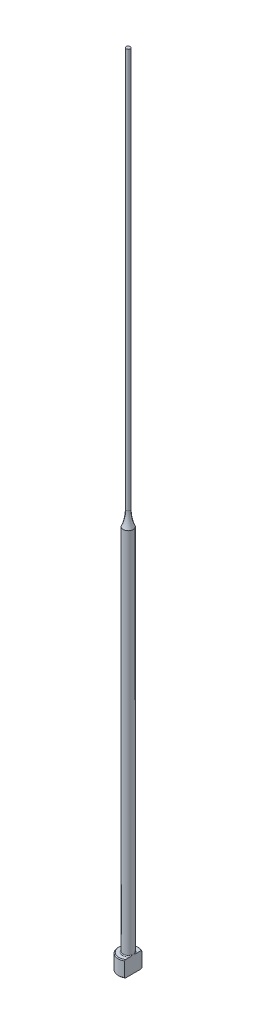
ISO-10303-21;
HEADER;
FILE_DESCRIPTION(('STEP AP214'),'2;1');
FILE_NAME('part.step','',(''),(''),'','','');
FILE_SCHEMA(('AUTOMOTIVE_DESIGN { 1 0 10303 214 1 1 1 1 }'));
ENDSEC;
DATA;
#1=APPLICATION_CONTEXT('core data for automotive mechanical design processes');
#2=APPLICATION_PROTOCOL_DEFINITION('international standard','automotive_design',2000,#1);
#3=PRODUCT_CONTEXT('',#1,'mechanical');
#4=PRODUCT('Part','Part','',(#3));
#5=PRODUCT_RELATED_PRODUCT_CATEGORY('part','',(#4));
#6=PRODUCT_DEFINITION_FORMATION('','',#4);
#7=PRODUCT_DEFINITION_CONTEXT('part definition',#1,'design');
#8=PRODUCT_DEFINITION('design','',#6,#7);
#9=PRODUCT_DEFINITION_SHAPE('','',#8);
#10=(LENGTH_UNIT() NAMED_UNIT(*) SI_UNIT(.MILLI.,.METRE.));
#11=(NAMED_UNIT(*) PLANE_ANGLE_UNIT() SI_UNIT($,.RADIAN.));
#12=(NAMED_UNIT(*) SI_UNIT($,.STERADIAN.) SOLID_ANGLE_UNIT());
#13=UNCERTAINTY_MEASURE_WITH_UNIT(LENGTH_MEASURE(1.E-05),#10,'distance_accuracy_value','');
#14=(GEOMETRIC_REPRESENTATION_CONTEXT(3) GLOBAL_UNCERTAINTY_ASSIGNED_CONTEXT((#13)) GLOBAL_UNIT_ASSIGNED_CONTEXT((#10,
#11,#12)) REPRESENTATION_CONTEXT('',''));
#15=CARTESIAN_POINT('',(0.,0.,0.));
#16=DIRECTION('',(0.,0.,1.));
#17=DIRECTION('',(1.,0.,0.));
#18=AXIS2_PLACEMENT_3D('',#15,#16,#17);
#19=CARTESIAN_POINT('',(-2.49999999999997,4.,0.));
#20=DIRECTION('',(0.,1.,0.));
#21=DIRECTION('',(0.,0.,1.));
#22=AXIS2_PLACEMENT_3D('',#19,#20,#21);
#23=PLANE('',#22);
#24=CARTESIAN_POINT('',(0.,4.,0.));
#25=DIRECTION('',(0.,1.,0.));
#26=DIRECTION('',(0.,0.,1.));
#27=AXIS2_PLACEMENT_3D('',#24,#25,#26);
#28=CIRCLE('',#27,2.3);
#29=CARTESIAN_POINT('',(1.24999999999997,4.,-1.9306734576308));
#30=VERTEX_POINT('',#29);
#31=CARTESIAN_POINT('',(1.24999999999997,4.,1.9306734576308));
#32=VERTEX_POINT('',#31);
#33=EDGE_CURVE('E187',#30,#32,#28,.T.);
#34=ORIENTED_EDGE('',*,*,#33,.T.);
#35=DIRECTION('',(0.,0.,-1.));
#36=VECTOR('',#35,1.);
#37=CARTESIAN_POINT('',(1.24999999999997,4.,0.));
#38=LINE('',#37,#36);
#39=CARTESIAN_POINT('',(1.24999999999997,3.99999999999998,0.734846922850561));
#40=VERTEX_POINT('',#39);
#41=EDGE_CURVE('E57',#32,#40,#38,.T.);
#42=ORIENTED_EDGE('',*,*,#41,.T.);
#43=CARTESIAN_POINT('',(0.,4.,0.));
#44=DIRECTION('',(0.,1.,0.));
#45=DIRECTION('',(0.,0.,1.));
#46=AXIS2_PLACEMENT_3D('',#43,#44,#45);
#47=CIRCLE('',#46,1.44999999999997);
#48=CARTESIAN_POINT('',(1.24999999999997,3.99999999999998,-0.734846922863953));
#49=VERTEX_POINT('',#48);
#50=EDGE_CURVE('E108',#40,#49,#47,.F.);
#51=ORIENTED_EDGE('',*,*,#50,.T.);
#52=EDGE_CURVE('E137',#49,#30,#38,.T.);
#53=ORIENTED_EDGE('',*,*,#52,.T.);
#54=EDGE_LOOP('',(#34,#42,#51,#53));
#55=FACE_BOUND('',#54,.T.);
#56=ADVANCED_FACE('F32',(#55),#23,.T.);
#57=CARTESIAN_POINT('',(0.,259.958771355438,0.));
#58=DIRECTION('',(0.,1.,0.));
#59=DIRECTION('',(0.,0.,1.));
#60=AXIS2_PLACEMENT_3D('',#57,#58,#59);
#61=CYLINDRICAL_SURFACE('',#60,2.49999999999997);
#62=CARTESIAN_POINT('',(0.,3.80000000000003,0.));
#63=DIRECTION('',(0.,1.,0.));
#64=DIRECTION('',(0.,0.,1.));
#65=AXIS2_PLACEMENT_3D('',#62,#63,#64);
#66=CIRCLE('',#65,2.49999999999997);
#67=CARTESIAN_POINT('',(1.24999999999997,3.80000000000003,2.16506350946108));
#68=VERTEX_POINT('',#67);
#69=CARTESIAN_POINT('',(1.24999999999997,3.80000000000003,-2.16506350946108));
#70=VERTEX_POINT('',#69);
#71=EDGE_CURVE('E105',#68,#70,#66,.F.);
#72=ORIENTED_EDGE('',*,*,#71,.T.);
#73=DIRECTION('',(0.,-1.,0.));
#74=VECTOR('',#73,1.);
#75=CARTESIAN_POINT('',(1.24999999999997,200.,-2.16506350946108));
#76=LINE('',#75,#74);
#77=CARTESIAN_POINT('',(1.24999999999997,0.199999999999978,-2.16506350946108));
#78=VERTEX_POINT('',#77);
#79=EDGE_CURVE('E193',#70,#78,#76,.T.);
#80=ORIENTED_EDGE('',*,*,#79,.T.);
#81=CARTESIAN_POINT('',(0.,0.199999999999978,0.));
#82=DIRECTION('',(0.,-1.,0.));
#83=DIRECTION('',(0.,0.,-1.));
#84=AXIS2_PLACEMENT_3D('',#81,#82,#83);
#85=CIRCLE('',#84,2.49999999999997);
#86=CARTESIAN_POINT('',(1.24999999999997,0.199999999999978,2.16506350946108));
#87=VERTEX_POINT('',#86);
#88=EDGE_CURVE('E100',#78,#87,#85,.F.);
#89=ORIENTED_EDGE('',*,*,#88,.T.);
#90=DIRECTION('',(0.,-1.,0.));
#91=VECTOR('',#90,1.);
#92=CARTESIAN_POINT('',(1.24999999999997,200.,2.16506350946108));
#93=LINE('',#92,#91);
#94=EDGE_CURVE('E93',#68,#87,#93,.T.);
#95=ORIENTED_EDGE('',*,*,#94,.F.);
#96=EDGE_LOOP('',(#72,#80,#89,#95));
#97=FACE_BOUND('',#96,.T.);
#98=ADVANCED_FACE('F158',(#97),#61,.T.);
#99=CARTESIAN_POINT('',(0.,0.,0.));
#100=DIRECTION('',(0.,-1.,0.));
#101=DIRECTION('',(0.,0.,-1.));
#102=AXIS2_PLACEMENT_3D('',#99,#100,#101);
#103=PLANE('',#102);
#104=CARTESIAN_POINT('',(0.,0.,0.));
#105=DIRECTION('',(0.,-1.,0.));
#106=DIRECTION('',(0.,0.,-1.));
#107=AXIS2_PLACEMENT_3D('',#104,#105,#106);
#108=CIRCLE('',#107,2.29999999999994);
#109=CARTESIAN_POINT('',(1.24999999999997,0.,1.93067345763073));
#110=VERTEX_POINT('',#109);
#111=CARTESIAN_POINT('',(1.24999999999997,0.,-1.93067345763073));
#112=VERTEX_POINT('',#111);
#113=EDGE_CURVE('E98',#110,#112,#108,.T.);
#114=ORIENTED_EDGE('',*,*,#113,.T.);
#115=DIRECTION('',(0.,0.,1.));
#116=VECTOR('',#115,1.);
#117=CARTESIAN_POINT('',(1.24999999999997,0.,2.16506350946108));
#118=LINE('',#117,#116);
#119=EDGE_CURVE('E83',#112,#110,#118,.T.);
#120=ORIENTED_EDGE('',*,*,#119,.T.);
#121=EDGE_LOOP('',(#114,#120));
#122=FACE_BOUND('',#121,.T.);
#123=ADVANCED_FACE('F103',(#122),#103,.T.);
#124=CARTESIAN_POINT('',(0.,4.,0.));
#125=DIRECTION('',(0.,-1.,0.));
#126=DIRECTION('',(0.,0.,-1.));
#127=AXIS2_PLACEMENT_3D('',#124,#125,#126);
#128=CONICAL_SURFACE('',#127,2.3,0.785398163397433);
#129=ORIENTED_EDGE('',*,*,#71,.F.);
#130=CARTESIAN_POINT('',(1.24999999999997,1.37269850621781,4.76610952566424));
#131=CARTESIAN_POINT('',(1.24999999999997,1.47721375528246,4.6580533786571));
#132=CARTESIAN_POINT('',(1.24999999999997,1.58161686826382,4.54988840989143));
#133=CARTESIAN_POINT('',(1.24999999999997,1.79013244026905,4.33327605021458));
#134=CARTESIAN_POINT('',(1.24999999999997,1.89424489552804,4.22482865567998));
#135=CARTESIAN_POINT('',(1.24999999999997,2.10216338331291,4.00753373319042));
#136=CARTESIAN_POINT('',(1.24999999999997,2.20596923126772,3.89868602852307));
#137=CARTESIAN_POINT('',(1.24999999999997,2.41312192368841,3.68055575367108));
#138=CARTESIAN_POINT('',(1.24999999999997,2.51646877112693,3.57127318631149));
#139=CARTESIAN_POINT('',(1.24999999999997,2.72052253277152,3.35432408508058));
#140=CARTESIAN_POINT('',(1.24999999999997,2.82124112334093,3.24666854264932));
#141=CARTESIAN_POINT('',(1.24999999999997,3.02192410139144,3.03065701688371));
#142=CARTESIAN_POINT('',(1.24999999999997,3.12188849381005,2.92230103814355));
#143=CARTESIAN_POINT('',(1.24999999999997,3.32077037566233,2.70467415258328));
#144=CARTESIAN_POINT('',(1.24999999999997,3.41968808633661,2.59540344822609));
#145=CARTESIAN_POINT('',(1.24999999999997,3.61608273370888,2.37557697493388));
#146=CARTESIAN_POINT('',(1.24999999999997,3.71355972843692,2.26502125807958));
#147=CARTESIAN_POINT('',(1.24999999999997,3.86911393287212,2.08515617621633));
#148=CARTESIAN_POINT('',(1.24999999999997,3.92785594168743,2.01642247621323));
#149=CARTESIAN_POINT('',(1.24999999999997,4.0442937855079,1.87806056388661));
#150=CARTESIAN_POINT('',(1.24999999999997,4.10198951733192,1.80843226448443));
#151=CARTESIAN_POINT('',(1.24999999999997,4.21658041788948,1.66728976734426));
#152=CARTESIAN_POINT('',(1.24999999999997,4.27346067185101,1.59576341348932));
#153=CARTESIAN_POINT('',(1.24999999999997,4.38522965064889,1.45118948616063));
#154=CARTESIAN_POINT('',(1.24999999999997,4.44011885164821,1.37814228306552));
#155=CARTESIAN_POINT('',(1.24999999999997,4.54788773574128,1.22886697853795));
#156=CARTESIAN_POINT('',(1.24999999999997,4.60072420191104,1.15260740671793));
#157=CARTESIAN_POINT('',(1.24999999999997,4.70212030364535,0.997098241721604));
#158=CARTESIAN_POINT('',(1.24999999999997,4.75067405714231,0.917844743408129));
#159=CARTESIAN_POINT('',(1.24999999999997,4.84043729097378,0.756494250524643));
#160=CARTESIAN_POINT('',(1.24999999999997,4.88173033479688,0.674444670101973));
#161=CARTESIAN_POINT('',(1.24999999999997,4.95366083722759,0.505835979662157));
#162=CARTESIAN_POINT('',(1.24999999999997,4.98433405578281,0.419293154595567));
#163=CARTESIAN_POINT('',(1.24999999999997,5.01753107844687,0.289507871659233));
#164=CARTESIAN_POINT('',(1.24999999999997,5.02633539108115,0.247870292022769));
#165=CARTESIAN_POINT('',(1.24999999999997,5.03997448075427,0.163937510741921));
#166=CARTESIAN_POINT('',(1.24999999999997,5.0448096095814,0.12164236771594));
#167=CARTESIAN_POINT('',(1.24999999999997,5.0501678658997,0.0369068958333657));
#168=CARTESIAN_POINT('',(1.24999999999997,5.05070431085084,-0.00553257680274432));
#169=CARTESIAN_POINT('',(1.24999999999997,5.04746162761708,-0.0902467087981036));
#170=CARTESIAN_POINT('',(1.24999999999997,5.04368214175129,-0.132521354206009));
#171=CARTESIAN_POINT('',(1.24999999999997,5.0321226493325,-0.21613542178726));
#172=CARTESIAN_POINT('',(1.24999999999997,5.02437758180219,-0.2574797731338));
#173=CARTESIAN_POINT('',(1.24999999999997,5.00536735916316,-0.339354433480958));
#174=CARTESIAN_POINT('',(1.24999999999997,4.99410082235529,-0.379884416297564));
#175=CARTESIAN_POINT('',(1.24999999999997,4.96852211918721,-0.460209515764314));
#176=CARTESIAN_POINT('',(1.24999999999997,4.954193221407,-0.499999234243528));
#177=CARTESIAN_POINT('',(1.24999999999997,4.92306392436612,-0.578577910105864));
#178=CARTESIAN_POINT('',(1.24999999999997,4.90626403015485,-0.617367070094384));
#179=CARTESIAN_POINT('',(1.24999999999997,4.85269034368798,-0.732719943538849));
#180=CARTESIAN_POINT('',(1.24999999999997,4.81287978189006,-0.807869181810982));
#181=CARTESIAN_POINT('',(1.24999999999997,4.72799210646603,-0.955157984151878));
#182=CARTESIAN_POINT('',(1.24999999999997,4.68290855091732,-1.02729371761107));
#183=CARTESIAN_POINT('',(1.24999999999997,4.58903993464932,-1.16950551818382));
#184=CARTESIAN_POINT('',(1.24999999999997,4.5402409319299,-1.23957230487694));
#185=CARTESIAN_POINT('',(1.24999999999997,4.44021824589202,-1.37788366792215));
#186=CARTESIAN_POINT('',(1.24999999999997,4.38899576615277,-1.44612912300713));
#187=CARTESIAN_POINT('',(1.24999999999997,4.28411092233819,-1.58215279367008));
#188=CARTESIAN_POINT('',(1.24999999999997,4.23042529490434,-1.64991298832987));
#189=CARTESIAN_POINT('',(1.24999999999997,4.12172412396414,-1.7843605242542));
#190=CARTESIAN_POINT('',(1.24999999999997,4.06670849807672,-1.85104779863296));
#191=CARTESIAN_POINT('',(1.24999999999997,3.90044437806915,-2.04954410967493));
#192=CARTESIAN_POINT('',(1.24999999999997,3.78772044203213,-2.1801152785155));
#193=CARTESIAN_POINT('',(1.24999999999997,3.57927088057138,-2.41711311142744));
#194=CARTESIAN_POINT('',(1.24999999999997,3.48391557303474,-2.52386864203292));
#195=CARTESIAN_POINT('',(1.24999999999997,3.29202937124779,-2.73632311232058));
#196=CARTESIAN_POINT('',(1.24999999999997,3.19549844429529,-2.84202202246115));
#197=CARTESIAN_POINT('',(1.24999999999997,2.90446939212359,-3.15815976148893));
#198=CARTESIAN_POINT('',(1.24999999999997,2.70871394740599,-3.36743889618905));
#199=CARTESIAN_POINT('',(1.24999999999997,2.32338273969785,-3.77561196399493));
#200=CARTESIAN_POINT('',(1.24999999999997,2.13388401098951,-3.97457897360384));
#201=CARTESIAN_POINT('',(1.24999999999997,1.84887947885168,-4.27209258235));
#202=CARTESIAN_POINT('',(1.24999999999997,1.75380504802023,-4.37105278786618));
#203=CARTESIAN_POINT('',(1.24999999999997,1.56341833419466,-4.56874260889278));
#204=CARTESIAN_POINT('',(1.24999999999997,1.46810605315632,-4.66747222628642));
#205=CARTESIAN_POINT('',(1.24999999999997,1.37269850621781,-4.76610952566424));
#206=B_SPLINE_CURVE_WITH_KNOTS('',3,(#130,#131,#132,#133,#134,#135,#136,#137,#138,#139,#140,
#141,#142,#143,#144,#145,#146,#147,#148,#149,#150,#151,#152,#153,#154,#155,#156,#157,#158,#159,
#160,#161,#162,#163,#164,#165,#166,#167,#168,#169,#170,#171,#172,#173,#174,#175,#176,#177,#178,
#179,#180,#181,#182,#183,#184,#185,#186,#187,#188,#189,#190,#191,#192,#193,#194,#195,#196,#197,
#198,#199,#200,#201,#202,#203,#204,#205),.UNSPECIFIED.,.F.,.F.,(4,2,2,2,2,2,2,2,2,2,2,2,2,2,2,2,
2,2,2,2,2,2,2,2,2,2,2,2,2,2,2,2,2,2,2,2,2,4),(0.,0.450994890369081,0.901995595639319,
1.35322763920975,1.80445675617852,2.24672733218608,2.6889950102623,3.13116725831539,
3.57332164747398,3.84456018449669,4.11582532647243,4.38995864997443,4.66402597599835,
4.94225842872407,5.22086725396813,5.49602313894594,5.77024327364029,5.89775644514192,
6.02525831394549,6.15236502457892,6.27948226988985,6.4054983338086,6.531563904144,
6.65833670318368,6.78508362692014,7.03983854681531,7.2949080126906,7.55098686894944,
7.80693985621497,8.06626716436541,8.32561057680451,8.84304654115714,9.27246240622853,
9.70189024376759,10.5615524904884,11.385852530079,11.7975442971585,12.2092326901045),.UNSPECIFIED.);
#207=EDGE_CURVE('E136',#68,#32,#206,.T.);
#208=ORIENTED_EDGE('',*,*,#207,.T.);
#209=ORIENTED_EDGE('',*,*,#33,.F.);
#210=EDGE_CURVE('E128',#30,#70,#206,.T.);
#211=ORIENTED_EDGE('',*,*,#210,.T.);
#212=EDGE_LOOP('',(#129,#208,#209,#211));
#213=FACE_BOUND('',#212,.T.);
#214=ADVANCED_FACE('F144',(#213),#128,.T.);
#215=CARTESIAN_POINT('',(0.,0.199999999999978,0.));
#216=DIRECTION('',(0.,1.,0.));
#217=DIRECTION('',(0.,0.,1.));
#218=AXIS2_PLACEMENT_3D('',#215,#216,#217);
#219=CONICAL_SURFACE('',#218,2.49999999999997,0.785398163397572);
#220=ORIENTED_EDGE('',*,*,#88,.F.);
#221=CARTESIAN_POINT('',(1.24999999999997,2.62730149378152,-4.76610952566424));
#222=CARTESIAN_POINT('',(1.24999999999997,2.52278624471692,-4.65805337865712));
#223=CARTESIAN_POINT('',(1.24999999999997,2.41838313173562,-4.54988840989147));
#224=CARTESIAN_POINT('',(1.24999999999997,2.20986755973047,-4.33327605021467));
#225=CARTESIAN_POINT('',(1.24999999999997,2.10575510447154,-4.22482865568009));
#226=CARTESIAN_POINT('',(1.24999999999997,1.89783661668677,-4.00753373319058));
#227=CARTESIAN_POINT('',(1.24999999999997,1.794030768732,-3.89868602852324));
#228=CARTESIAN_POINT('',(1.24999999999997,1.58687807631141,-3.6805557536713));
#229=CARTESIAN_POINT('',(1.24999999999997,1.48353122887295,-3.57127318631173));
#230=CARTESIAN_POINT('',(1.24999999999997,1.27947746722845,-3.35432408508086));
#231=CARTESIAN_POINT('',(1.24999999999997,1.17875887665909,-3.24666854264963));
#232=CARTESIAN_POINT('',(1.24999999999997,0.978075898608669,-3.03065701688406));
#233=CARTESIAN_POINT('',(1.24999999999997,0.878111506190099,-2.92230103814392));
#234=CARTESIAN_POINT('',(1.24999999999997,0.67922962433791,-2.70467415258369));
#235=CARTESIAN_POINT('',(1.24999999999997,0.580311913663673,-2.59540344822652));
#236=CARTESIAN_POINT('',(1.24999999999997,0.383917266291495,-2.37557697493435));
#237=CARTESIAN_POINT('',(1.24999999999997,0.286440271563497,-2.26502125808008));
#238=CARTESIAN_POINT('',(1.24999999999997,0.130886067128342,-2.08515617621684));
#239=CARTESIAN_POINT('',(1.24999999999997,0.0721440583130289,-2.01642247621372));
#240=CARTESIAN_POINT('',(1.24999999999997,-0.0442937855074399,-1.87806056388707));
#241=CARTESIAN_POINT('',(1.24999999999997,-0.101989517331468,-1.80843226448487));
#242=CARTESIAN_POINT('',(1.24999999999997,-0.216580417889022,-1.66728976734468));
#243=CARTESIAN_POINT('',(1.24999999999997,-0.273460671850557,-1.59576341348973));
#244=CARTESIAN_POINT('',(1.24999999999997,-0.385229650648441,-1.45118948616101));
#245=CARTESIAN_POINT('',(1.24999999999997,-0.440118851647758,-1.37814228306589));
#246=CARTESIAN_POINT('',(1.24999999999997,-0.547887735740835,-1.22886697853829));
#247=CARTESIAN_POINT('',(1.24999999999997,-0.600724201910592,-1.15260740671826));
#248=CARTESIAN_POINT('',(1.24999999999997,-0.702120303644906,-0.99709824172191));
#249=CARTESIAN_POINT('',(1.24999999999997,-0.750674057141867,-0.917844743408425));
#250=CARTESIAN_POINT('',(1.24999999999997,-0.840437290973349,-0.756494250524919));
#251=CARTESIAN_POINT('',(1.24999999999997,-0.881730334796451,-0.67444467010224));
#252=CARTESIAN_POINT('',(1.24999999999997,-0.953660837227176,-0.505835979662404));
#253=CARTESIAN_POINT('',(1.24999999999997,-0.984334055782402,-0.419293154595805));
#254=CARTESIAN_POINT('',(1.24999999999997,-1.01753107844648,-0.289507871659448));
#255=CARTESIAN_POINT('',(1.24999999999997,-1.02633539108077,-0.247870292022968));
#256=CARTESIAN_POINT('',(1.24999999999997,-1.0399744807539,-0.163937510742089));
#257=CARTESIAN_POINT('',(1.24999999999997,-1.04480960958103,-0.121642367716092));
#258=CARTESIAN_POINT('',(1.24999999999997,-1.05016786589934,-0.036906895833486));
#259=CARTESIAN_POINT('',(1.24999999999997,-1.05070431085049,0.00553257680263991));
#260=CARTESIAN_POINT('',(1.24999999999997,-1.04746162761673,0.0902467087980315));
#261=CARTESIAN_POINT('',(1.24999999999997,-1.04368214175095,0.132521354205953));
#262=CARTESIAN_POINT('',(1.24999999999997,-1.03212264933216,0.216135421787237));
#263=CARTESIAN_POINT('',(1.24999999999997,-1.02437758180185,0.257479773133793));
#264=CARTESIAN_POINT('',(1.24999999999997,-1.00536735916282,0.339354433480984));
#265=CARTESIAN_POINT('',(1.24999999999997,-0.99410082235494,0.379884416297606));
#266=CARTESIAN_POINT('',(1.24999999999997,-0.968522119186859,0.460209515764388));
#267=CARTESIAN_POINT('',(1.24999999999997,-0.954193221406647,0.499999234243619));
#268=CARTESIAN_POINT('',(1.24999999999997,-0.923063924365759,0.578577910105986));
#269=CARTESIAN_POINT('',(1.24999999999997,-0.906264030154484,0.617367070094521));
#270=CARTESIAN_POINT('',(1.24999999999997,-0.852690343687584,0.732719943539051));
#271=CARTESIAN_POINT('',(1.24999999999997,-0.812879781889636,0.807869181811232));
#272=CARTESIAN_POINT('',(1.24999999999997,-0.72799210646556,0.955157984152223));
#273=CARTESIAN_POINT('',(1.24999999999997,-0.682908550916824,1.02729371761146));
#274=CARTESIAN_POINT('',(1.24999999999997,-0.58903993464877,1.1695055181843));
#275=CARTESIAN_POINT('',(1.24999999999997,-0.540240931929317,1.23957230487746));
#276=CARTESIAN_POINT('',(1.24999999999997,-0.440218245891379,1.37788366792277));
#277=CARTESIAN_POINT('',(1.24999999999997,-0.388995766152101,1.44612912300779));
#278=CARTESIAN_POINT('',(1.24999999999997,-0.284110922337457,1.58215279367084));
#279=CARTESIAN_POINT('',(1.24999999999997,-0.230425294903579,1.64991298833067));
#280=CARTESIAN_POINT('',(1.24999999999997,-0.121724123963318,1.78436052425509));
#281=CARTESIAN_POINT('',(1.24999999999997,-0.066708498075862,1.8510477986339));
#282=CARTESIAN_POINT('',(1.24999999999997,0.0995556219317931,2.049544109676));
#283=CARTESIAN_POINT('',(1.24999999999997,0.212279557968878,2.18011527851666));
#284=CARTESIAN_POINT('',(1.24999999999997,0.420729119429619,2.41711311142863));
#285=CARTESIAN_POINT('',(1.24999999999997,0.516084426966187,2.52386864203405));
#286=CARTESIAN_POINT('',(1.24999999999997,0.707970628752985,2.73632311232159));
#287=CARTESIAN_POINT('',(1.24999999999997,0.804501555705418,2.84202202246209));
#288=CARTESIAN_POINT('',(1.24999999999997,1.09553060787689,3.1581597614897));
#289=CARTESIAN_POINT('',(1.24999999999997,1.29128605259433,3.36743889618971));
#290=CARTESIAN_POINT('',(1.24999999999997,1.67661726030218,3.77561196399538));
#291=CARTESIAN_POINT('',(1.24999999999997,1.86611598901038,3.97457897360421));
#292=CARTESIAN_POINT('',(1.24999999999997,2.151120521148,4.27209258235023));
#293=CARTESIAN_POINT('',(1.24999999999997,2.24619495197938,4.37105278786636));
#294=CARTESIAN_POINT('',(1.24999999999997,2.43658166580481,4.56874260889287));
#295=CARTESIAN_POINT('',(1.24999999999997,2.53189394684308,4.66747222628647));
#296=CARTESIAN_POINT('',(1.24999999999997,2.62730149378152,4.76610952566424));
#297=B_SPLINE_CURVE_WITH_KNOTS('',3,(#221,#222,#223,#224,#225,#226,#227,#228,#229,#230,#231,
#232,#233,#234,#235,#236,#237,#238,#239,#240,#241,#242,#243,#244,#245,#246,#247,#248,#249,#250,
#251,#252,#253,#254,#255,#256,#257,#258,#259,#260,#261,#262,#263,#264,#265,#266,#267,#268,#269,
#270,#271,#272,#273,#274,#275,#276,#277,#278,#279,#280,#281,#282,#283,#284,#285,#286,#287,#288,
#289,#290,#291,#292,#293,#294,#295,#296),.UNSPECIFIED.,.F.,.F.,(4,2,2,2,2,2,2,2,2,2,2,2,2,2,2,2,
2,2,2,2,2,2,2,2,2,2,2,2,2,2,2,2,2,2,2,2,2,4),(0.,0.45099489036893,0.901995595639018,
1.3532276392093,1.80445675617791,2.24672733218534,2.68899501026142,3.13116725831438,
3.57332164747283,3.84456018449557,4.11582532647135,4.38995864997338,4.66402597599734,
4.94225842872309,5.22086725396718,5.49602313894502,5.77024327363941,5.89775644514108,
6.0252583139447,6.15236502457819,6.27948226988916,6.40549833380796,6.5315639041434,
6.65833670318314,6.78508362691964,7.03983854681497,7.29490801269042,7.55098686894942,
7.80693985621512,8.06626716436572,8.32561057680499,8.84304654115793,9.27246240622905,
9.70189024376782,10.5615524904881,11.3858525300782,11.7975442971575,12.2092326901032),.UNSPECIFIED.);
#298=EDGE_CURVE('E86',#78,#112,#297,.T.);
#299=ORIENTED_EDGE('',*,*,#298,.T.);
#300=ORIENTED_EDGE('',*,*,#113,.F.);
#301=EDGE_CURVE('E89',#110,#87,#297,.T.);
#302=ORIENTED_EDGE('',*,*,#301,.T.);
#303=EDGE_LOOP('',(#220,#299,#300,#302));
#304=FACE_BOUND('',#303,.T.);
#305=ADVANCED_FACE('F97',(#304),#219,.T.);
#306=CARTESIAN_POINT('',(0.,4.19999999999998,0.));
#307=DIRECTION('',(0.,1.,0.));
#308=DIRECTION('',(0.,0.,1.));
#309=AXIS2_PLACEMENT_3D('',#306,#307,#308);
#310=TOROIDAL_SURFACE('',#309,1.44999999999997,0.2);
#311=CARTESIAN_POINT('',(1.24999999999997,4.19999999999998,0.));
#312=CARTESIAN_POINT('',(1.24999999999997,4.20000051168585,-1.97682160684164E-10));
#313=CARTESIAN_POINT('',(1.24999999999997,4.20000102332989,-1.08908071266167E-07));
#314=CARTESIAN_POINT('',(1.24999999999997,4.20000200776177,-4.52594777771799E-07));
#315=CARTESIAN_POINT('',(1.24999999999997,4.20000247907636,-6.9099305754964E-07));
#316=CARTESIAN_POINT('',(1.24999999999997,4.20000341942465,-1.26357946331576E-06));
#317=CARTESIAN_POINT('',(1.24999999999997,4.20000388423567,-1.60457621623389E-06));
#318=CARTESIAN_POINT('',(1.24999999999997,4.20000476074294,-2.33954904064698E-06));
#319=CARTESIAN_POINT('',(1.24999999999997,4.2000051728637,-2.73304152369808E-06));
#320=CARTESIAN_POINT('',(1.24999999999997,4.20000655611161,-4.14544018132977E-06));
#321=CARTESIAN_POINT('',(1.24999999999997,4.20000745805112,-5.23310098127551E-06));
#322=CARTESIAN_POINT('',(1.24999999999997,4.20000906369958,-7.47950368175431E-06));
#323=CARTESIAN_POINT('',(1.24999999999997,4.20000977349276,-8.63414445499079E-06));
#324=CARTESIAN_POINT('',(1.24999999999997,4.20001244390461,-1.31453477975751E-05));
#325=CARTESIAN_POINT('',(1.24999999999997,4.20001426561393,-1.65880556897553E-05));
#326=CARTESIAN_POINT('',(1.24999999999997,4.20001724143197,-2.33729030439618E-05));
#327=CARTESIAN_POINT('',(1.24999999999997,4.20001844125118,-2.66956155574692E-05));
#328=CARTESIAN_POINT('',(1.24999999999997,4.20002354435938,-4.08635087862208E-05));
#329=CARTESIAN_POINT('',(1.24999999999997,4.20002741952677,-5.17114616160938E-05));
#330=CARTESIAN_POINT('',(1.24999999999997,4.20003363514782,-7.2005767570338E-05));
#331=CARTESIAN_POINT('',(1.24999999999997,4.20003612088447,-8.14057067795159E-05));
#332=CARTESIAN_POINT('',(1.24999999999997,4.20005581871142,-0.000149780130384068));
#333=CARTESIAN_POINT('',(1.24999999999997,4.20008094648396,-0.00020612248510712));
#334=CARTESIAN_POINT('',(1.24999999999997,4.20017507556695,-0.000425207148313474));
#335=CARTESIAN_POINT('',(1.24999999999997,4.20023819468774,-0.000589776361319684));
#336=CARTESIAN_POINT('',(1.24999999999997,4.20048692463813,-0.00122878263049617));
#337=CARTESIAN_POINT('',(1.24999999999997,4.20067870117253,-0.00170134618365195));
#338=CARTESIAN_POINT('',(1.24999999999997,4.2014602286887,-0.00363636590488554));
#339=CARTESIAN_POINT('',(1.24999999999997,4.20204298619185,-0.00510090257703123));
#340=CARTESIAN_POINT('',(1.24999999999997,4.20939719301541,-0.0235712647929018));
#341=CARTESIAN_POINT('',(1.24999999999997,4.21621259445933,-0.0405643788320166));
#342=CARTESIAN_POINT('',(1.24999999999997,4.22951000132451,-0.0739606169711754));
#343=CARTESIAN_POINT('',(1.24999999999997,4.23599508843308,-0.0903626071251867));
#344=CARTESIAN_POINT('',(1.24999999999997,4.24961430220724,-0.125111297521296));
#345=CARTESIAN_POINT('',(1.24999999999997,4.2567364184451,-0.1434628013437));
#346=CARTESIAN_POINT('',(1.24999999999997,4.27085039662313,-0.180427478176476));
#347=CARTESIAN_POINT('',(1.24999999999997,4.27784022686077,-0.199041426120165));
#348=CARTESIAN_POINT('',(1.24999999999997,4.29479134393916,-0.245221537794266));
#349=CARTESIAN_POINT('',(1.24999999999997,4.30459026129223,-0.272848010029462));
#350=CARTESIAN_POINT('',(1.24999999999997,4.32310234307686,-0.327738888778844));
#351=CARTESIAN_POINT('',(1.24999999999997,4.3318356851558,-0.354996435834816));
#352=CARTESIAN_POINT('',(1.24999999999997,4.3493656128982,-0.413744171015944));
#353=CARTESIAN_POINT('',(1.24999999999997,4.35799470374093,-0.44528522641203));
#354=CARTESIAN_POINT('',(1.24999999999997,4.37338463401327,-0.50909191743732));
#355=CARTESIAN_POINT('',(1.24999999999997,4.38013036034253,-0.541361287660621));
#356=CARTESIAN_POINT('',(1.24999999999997,4.39136059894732,-0.608339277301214));
#357=CARTESIAN_POINT('',(1.24999999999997,4.39568167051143,-0.643076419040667));
#358=CARTESIAN_POINT('',(1.24999999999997,4.40037605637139,-0.712733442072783));
#359=CARTESIAN_POINT('',(1.24999999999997,4.40076553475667,-0.747651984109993));
#360=CARTESIAN_POINT('',(1.24999999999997,4.39677668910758,-0.808103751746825));
#361=CARTESIAN_POINT('',(1.24999999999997,4.39361441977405,-0.833711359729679));
#362=CARTESIAN_POINT('',(1.24999999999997,4.38355990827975,-0.883915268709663));
#363=CARTESIAN_POINT('',(1.24999999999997,4.37671813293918,-0.908520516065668));
#364=CARTESIAN_POINT('',(1.24999999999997,4.36252570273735,-0.944879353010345));
#365=CARTESIAN_POINT('',(1.24999999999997,4.35688428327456,-0.957298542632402));
#366=CARTESIAN_POINT('',(1.24999999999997,4.34399066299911,-0.981318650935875));
#367=CARTESIAN_POINT('',(1.24999999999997,4.33673636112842,-0.992918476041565));
#368=CARTESIAN_POINT('',(1.24999999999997,4.32199744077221,-1.01267533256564));
#369=CARTESIAN_POINT('',(1.24999999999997,4.31482723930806,-1.02106482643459));
#370=CARTESIAN_POINT('',(1.24999999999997,4.29924321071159,-1.03659690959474));
#371=CARTESIAN_POINT('',(1.24999999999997,4.29083198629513,-1.04374204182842));
#372=CARTESIAN_POINT('',(1.24999999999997,4.27498600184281,-1.05478694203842));
#373=CARTESIAN_POINT('',(1.24999999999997,4.26780814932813,-1.059053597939));
#374=CARTESIAN_POINT('',(1.24999999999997,4.25284782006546,-1.06635953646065));
#375=CARTESIAN_POINT('',(1.24999999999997,4.24506572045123,-1.06939957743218));
#376=CARTESIAN_POINT('',(1.24999999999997,4.22901828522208,-1.07404931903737));
#377=CARTESIAN_POINT('',(1.24999999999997,4.22074990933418,-1.07564870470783));
#378=CARTESIAN_POINT('',(1.24999999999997,4.20405985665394,-1.07723717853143));
#379=CARTESIAN_POINT('',(1.24999999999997,4.19563825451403,-1.07722703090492));
#380=CARTESIAN_POINT('',(1.24999999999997,4.17988128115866,-1.07569157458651));
#381=CARTESIAN_POINT('',(1.24999999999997,4.17252879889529,-1.0743339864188));
#382=CARTESIAN_POINT('',(1.24999999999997,4.15814333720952,-1.07044616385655));
#383=CARTESIAN_POINT('',(1.24999999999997,4.15111040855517,-1.06791574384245));
#384=CARTESIAN_POINT('',(1.24999999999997,4.13724955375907,-1.06171920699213));
#385=CARTESIAN_POINT('',(1.24999999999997,4.13043935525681,-1.05801386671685));
#386=CARTESIAN_POINT('',(1.24999999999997,4.11740316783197,-1.04969609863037));
#387=CARTESIAN_POINT('',(1.24999999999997,4.11117742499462,-1.04508329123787));
#388=CARTESIAN_POINT('',(1.24999999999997,4.0958619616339,-1.03220341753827));
#389=CARTESIAN_POINT('',(1.24999999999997,4.08723799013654,-1.02338140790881));
#390=CARTESIAN_POINT('',(1.24999999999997,4.07148817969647,-1.00448021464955));
#391=CARTESIAN_POINT('',(1.24999999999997,4.06436716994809,-0.994397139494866));
#392=CARTESIAN_POINT('',(1.24999999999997,4.04800089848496,-0.96769446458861));
#393=CARTESIAN_POINT('',(1.24999999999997,4.0397014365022,-0.950498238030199));
#394=CARTESIAN_POINT('',(1.24999999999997,4.02582422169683,-0.915117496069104));
#395=CARTESIAN_POINT('',(1.24999999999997,4.02024415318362,-0.89693383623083));
#396=CARTESIAN_POINT('',(1.24999999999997,4.00805724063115,-0.846781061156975));
#397=CARTESIAN_POINT('',(1.24999999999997,4.00359525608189,-0.814297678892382));
#398=CARTESIAN_POINT('',(1.24999999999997,3.99933348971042,-0.748574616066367));
#399=CARTESIAN_POINT('',(1.24999999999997,3.99961552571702,-0.71533156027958));
#400=CARTESIAN_POINT('',(1.24999999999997,4.00446632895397,-0.637920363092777));
#401=CARTESIAN_POINT('',(1.24999999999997,4.0104488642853,-0.593849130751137));
#402=CARTESIAN_POINT('',(1.24999999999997,4.02681929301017,-0.50640159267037));
#403=CARTESIAN_POINT('',(1.24999999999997,4.03722697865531,-0.463029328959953));
#404=CARTESIAN_POINT('',(1.24999999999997,4.060071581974,-0.380638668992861));
#405=CARTESIAN_POINT('',(1.24999999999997,4.07227412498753,-0.34155342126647));
#406=CARTESIAN_POINT('',(1.24999999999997,4.09824323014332,-0.264347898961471));
#407=CARTESIAN_POINT('',(1.24999999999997,4.11199311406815,-0.226221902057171));
#408=CARTESIAN_POINT('',(1.24999999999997,4.13108825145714,-0.175350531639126));
#409=CARTESIAN_POINT('',(1.24999999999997,4.13599999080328,-0.162438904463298));
#410=CARTESIAN_POINT('',(1.24999999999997,4.14604281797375,-0.136318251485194));
#411=CARTESIAN_POINT('',(1.24999999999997,4.15117629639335,-0.123110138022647));
#412=CARTESIAN_POINT('',(1.24999999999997,4.16341702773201,-0.0918425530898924));
#413=CARTESIAN_POINT('',(1.24999999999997,4.17055250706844,-0.0737943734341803));
#414=CARTESIAN_POINT('',(1.24999999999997,4.18426943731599,-0.0393586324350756));
#415=CARTESIAN_POINT('',(1.24999999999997,4.19084281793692,-0.0229681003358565));
#416=CARTESIAN_POINT('',(1.24999999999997,4.19795564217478,-0.00510438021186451));
#417=CARTESIAN_POINT('',(1.24999999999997,4.19853702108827,-0.00364331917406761));
#418=CARTESIAN_POINT('',(1.24999999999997,4.19931818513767,-0.00170914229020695));
#419=CARTESIAN_POINT('',(1.24999999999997,4.19951102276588,-0.00123396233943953));
#420=CARTESIAN_POINT('',(1.24999999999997,4.19976104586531,-0.000591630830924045));
#421=CARTESIAN_POINT('',(1.24999999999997,4.19982443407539,-0.000426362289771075));
#422=CARTESIAN_POINT('',(1.24999999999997,4.19991892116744,-0.000206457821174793));
#423=CARTESIAN_POINT('',(1.24999999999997,4.19994410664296,-0.000149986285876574));
#424=CARTESIAN_POINT('',(1.24999999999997,4.19996383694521,-8.14647488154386E-05));
#425=CARTESIAN_POINT('',(1.24999999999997,4.19996632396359,-7.20551568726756E-05));
#426=CARTESIAN_POINT('',(1.24999999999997,4.19997254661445,-5.17396177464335E-05));
#427=CARTESIAN_POINT('',(1.24999999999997,4.19997642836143,-4.08803463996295E-05));
#428=CARTESIAN_POINT('',(1.24999999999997,4.19998153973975,-2.66997573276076E-05));
#429=CARTESIAN_POINT('',(1.24999999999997,4.19998274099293,-2.33755457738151E-05));
#430=CARTESIAN_POINT('',(1.24999999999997,4.1999857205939,-1.65878758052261E-05));
#431=CARTESIAN_POINT('',(1.24999999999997,4.19998754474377,-1.31438994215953E-05));
#432=CARTESIAN_POINT('',(1.24999999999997,4.19999021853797,-8.63150511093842E-06));
#433=CARTESIAN_POINT('',(1.24999999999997,4.19999092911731,-7.47674880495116E-06));
#434=CARTESIAN_POINT('',(1.24999999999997,4.19999253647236,-5.23027080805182E-06));
#435=CARTESIAN_POINT('',(1.24999999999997,4.19999343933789,-4.14265821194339E-06));
#436=CARTESIAN_POINT('',(1.24999999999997,4.19999482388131,-2.73051190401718E-06));
#437=CARTESIAN_POINT('',(1.24999999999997,4.19999523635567,-2.33712918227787E-06));
#438=CARTESIAN_POINT('',(1.24999999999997,4.1999961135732,-1.60243917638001E-06));
#439=CARTESIAN_POINT('',(1.24999999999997,4.19999657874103,-1.26161620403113E-06));
#440=CARTESIAN_POINT('',(1.24999999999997,4.19999751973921,-6.89449589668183E-07));
#441=CARTESIAN_POINT('',(1.24999999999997,4.1999979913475,-4.51288695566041E-07));
#442=CARTESIAN_POINT('',(1.24999999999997,4.19999897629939,-1.08178106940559E-07));
#443=CARTESIAN_POINT('',(1.24999999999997,4.19999948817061,1.97737602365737E-10));
#444=CARTESIAN_POINT('',(1.24999999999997,4.19999999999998,0.));
#445=B_SPLINE_CURVE_WITH_KNOTS('',3,(#311,#312,#313,#314,#315,#316,#317,#318,#319,#320,#321,
#322,#323,#324,#325,#326,#327,#328,#329,#330,#331,#332,#333,#334,#335,#336,#337,#338,#339,#340,
#341,#342,#343,#344,#345,#346,#347,#348,#349,#350,#351,#352,#353,#354,#355,#356,#357,#358,#359,
#360,#361,#362,#363,#364,#365,#366,#367,#368,#369,#370,#371,#372,#373,#374,#375,#376,#377,#378,
#379,#380,#381,#382,#383,#384,#385,#386,#387,#388,#389,#390,#391,#392,#393,#394,#395,#396,#397,
#398,#399,#400,#401,#402,#403,#404,#405,#406,#407,#408,#409,#410,#411,#412,#413,#414,#415,#416,
#417,#418,#419,#420,#421,#422,#423,#424,#425,#426,#427,#428,#429,#430,#431,#432,#433,#434,#435,
#436,#437,#438,#439,#440,#441,#442,#443,#444),.UNSPECIFIED.,.T.,.F.,(4,2,2,2,2,2,2,2,2,2,2,2,2,
2,2,2,2,2,2,2,2,2,2,2,2,2,2,2,2,2,2,2,2,2,2,2,2,2,2,2,2,2,2,2,2,2,2,2,2,2,2,2,2,2,2,2,2,2,2,2,2,
2,2,2,2,2,4),(0.,1.53427571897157E-06,3.11115051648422E-06,4.83351630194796E-06,
6.54098938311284E-06,1.07594292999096E-05,1.48222850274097E-05,2.64707312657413E-05,
3.70576286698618E-05,7.16088725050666E-05,0.000100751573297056,0.000285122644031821,
0.00081447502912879,0.00234373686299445,0.00707317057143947,0.0619940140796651,
0.114907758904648,0.17396170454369,0.233609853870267,0.321537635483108,0.40738870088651,
0.505443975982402,0.604264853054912,0.709126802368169,0.813557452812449,0.890773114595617,
0.966955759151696,1.00778845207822,1.04867465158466,1.08167318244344,1.11460346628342,
1.13955805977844,1.16449720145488,1.1896135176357,1.2147179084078,1.23704542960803,
1.25937648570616,1.28254952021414,1.30573226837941,1.34253218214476,1.37944859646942,
1.43640829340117,1.49331940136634,1.59113685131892,1.69064301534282,1.82371118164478,
1.9573808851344,2.08016146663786,2.20172662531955,2.2431696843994,2.28568093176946,
2.34390494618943,2.39687801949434,2.40159623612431,2.40313396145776,2.40366556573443,
2.40385035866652,2.40387953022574,2.403914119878,2.40392471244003,2.403936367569,
2.4039404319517,2.40394465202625,2.40394636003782,2.403948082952,2.40394966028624,
2.40395119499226),.UNSPECIFIED.);
#446=CARTESIAN_POINT('',(1.24999999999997,4.19999999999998,0.));
#447=VERTEX_POINT('',#446);
#448=EDGE_CURVE('E11',#49,#447,#445,.T.);
#449=ORIENTED_EDGE('',*,*,#448,.F.);
#450=ORIENTED_EDGE('',*,*,#50,.F.);
#451=CARTESIAN_POINT('',(1.24999999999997,4.19999999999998,0.));
#452=CARTESIAN_POINT('',(1.24999999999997,4.19999948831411,1.9768217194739E-10));
#453=CARTESIAN_POINT('',(1.24999999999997,4.19999897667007,1.08908071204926E-07));
#454=CARTESIAN_POINT('',(1.24999999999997,4.19999799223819,4.52594777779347E-07));
#455=CARTESIAN_POINT('',(1.24999999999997,4.19999752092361,6.9099305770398E-07));
#456=CARTESIAN_POINT('',(1.24999999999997,4.19999658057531,1.26357946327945E-06));
#457=CARTESIAN_POINT('',(1.24999999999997,4.19999611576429,1.6045762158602E-06));
#458=CARTESIAN_POINT('',(1.24999999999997,4.19999523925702,2.33954904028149E-06));
#459=CARTESIAN_POINT('',(1.24999999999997,4.19999482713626,2.73304152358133E-06));
#460=CARTESIAN_POINT('',(1.24999999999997,4.19999344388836,4.14544018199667E-06));
#461=CARTESIAN_POINT('',(1.24999999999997,4.19999254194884,5.23310098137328E-06));
#462=CARTESIAN_POINT('',(1.24999999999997,4.19999093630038,7.47950368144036E-06));
#463=CARTESIAN_POINT('',(1.24999999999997,4.19999022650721,8.63414445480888E-06));
#464=CARTESIAN_POINT('',(1.24999999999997,4.19998755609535,1.31453477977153E-05));
#465=CARTESIAN_POINT('',(1.24999999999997,4.19998573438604,1.65880556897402E-05));
#466=CARTESIAN_POINT('',(1.24999999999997,4.19998275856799,2.33729030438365E-05));
#467=CARTESIAN_POINT('',(1.24999999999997,4.19998155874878,2.66956155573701E-05));
#468=CARTESIAN_POINT('',(1.24999999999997,4.19997645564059,4.0863508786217E-05));
#469=CARTESIAN_POINT('',(1.24999999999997,4.1999725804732,5.17114616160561E-05));
#470=CARTESIAN_POINT('',(1.24999999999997,4.19996636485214,7.20057675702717E-05));
#471=CARTESIAN_POINT('',(1.24999999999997,4.19996387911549,8.1405706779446E-05));
#472=CARTESIAN_POINT('',(1.24999999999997,4.19994418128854,0.000149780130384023));
#473=CARTESIAN_POINT('',(1.24999999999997,4.199919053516,0.000206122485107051));
#474=CARTESIAN_POINT('',(1.24999999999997,4.19982492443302,0.000425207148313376));
#475=CARTESIAN_POINT('',(1.24999999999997,4.19976180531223,0.000589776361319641));
#476=CARTESIAN_POINT('',(1.24999999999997,4.19951307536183,0.00122878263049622));
#477=CARTESIAN_POINT('',(1.24999999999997,4.19932129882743,0.00170134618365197));
#478=CARTESIAN_POINT('',(1.24999999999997,4.19853977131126,0.00363636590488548));
#479=CARTESIAN_POINT('',(1.24999999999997,4.19795701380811,0.0051009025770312));
#480=CARTESIAN_POINT('',(1.24999999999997,4.19060280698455,0.0235712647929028));
#481=CARTESIAN_POINT('',(1.24999999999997,4.18378740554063,0.0405643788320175));
#482=CARTESIAN_POINT('',(1.24999999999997,4.17048999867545,0.073960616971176));
#483=CARTESIAN_POINT('',(1.24999999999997,4.16400491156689,0.0903626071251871));
#484=CARTESIAN_POINT('',(1.24999999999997,4.15038569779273,0.125111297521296));
#485=CARTESIAN_POINT('',(1.24999999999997,4.14326358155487,0.1434628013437));
#486=CARTESIAN_POINT('',(1.24999999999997,4.12914960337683,0.180427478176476));
#487=CARTESIAN_POINT('',(1.24999999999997,4.12215977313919,0.199041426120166));
#488=CARTESIAN_POINT('',(1.24999999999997,4.1052086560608,0.245221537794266));
#489=CARTESIAN_POINT('',(1.24999999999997,4.09540973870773,0.272848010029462));
#490=CARTESIAN_POINT('',(1.24999999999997,4.0768976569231,0.327738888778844));
#491=CARTESIAN_POINT('',(1.24999999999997,4.06816431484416,0.354996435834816));
#492=CARTESIAN_POINT('',(1.24999999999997,4.05063438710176,0.413744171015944));
#493=CARTESIAN_POINT('',(1.24999999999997,4.04200529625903,0.44528522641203));
#494=CARTESIAN_POINT('',(1.24999999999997,4.0266153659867,0.50909191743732));
#495=CARTESIAN_POINT('',(1.24999999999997,4.01986963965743,0.541361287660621));
#496=CARTESIAN_POINT('',(1.24999999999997,4.00863940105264,0.608339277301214));
#497=CARTESIAN_POINT('',(1.24999999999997,4.00431832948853,0.643076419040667));
#498=CARTESIAN_POINT('',(1.24999999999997,3.99962394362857,0.712733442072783));
#499=CARTESIAN_POINT('',(1.24999999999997,3.99923446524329,0.747651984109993));
#500=CARTESIAN_POINT('',(1.24999999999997,4.00322331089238,0.808103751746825));
#501=CARTESIAN_POINT('',(1.24999999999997,4.00638558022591,0.833711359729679));
#502=CARTESIAN_POINT('',(1.24999999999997,4.01644009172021,0.883915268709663));
#503=CARTESIAN_POINT('',(1.24999999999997,4.02328186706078,0.908520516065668));
#504=CARTESIAN_POINT('',(1.24999999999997,4.03747429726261,0.944879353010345));
#505=CARTESIAN_POINT('',(1.24999999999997,4.0431157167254,0.957298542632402));
#506=CARTESIAN_POINT('',(1.24999999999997,4.05600933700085,0.981318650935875));
#507=CARTESIAN_POINT('',(1.24999999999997,4.06326363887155,0.992918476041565));
#508=CARTESIAN_POINT('',(1.24999999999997,4.07800255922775,1.01267533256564));
#509=CARTESIAN_POINT('',(1.24999999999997,4.08517276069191,1.02106482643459));
#510=CARTESIAN_POINT('',(1.24999999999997,4.10075678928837,1.03659690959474));
#511=CARTESIAN_POINT('',(1.24999999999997,4.10916801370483,1.04374204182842));
#512=CARTESIAN_POINT('',(1.24999999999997,4.12501399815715,1.05478694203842));
#513=CARTESIAN_POINT('',(1.24999999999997,4.13219185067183,1.059053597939));
#514=CARTESIAN_POINT('',(1.24999999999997,4.1471521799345,1.06635953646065));
#515=CARTESIAN_POINT('',(1.24999999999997,4.15493427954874,1.06939957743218));
#516=CARTESIAN_POINT('',(1.24999999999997,4.17098171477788,1.07404931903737));
#517=CARTESIAN_POINT('',(1.24999999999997,4.17925009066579,1.07564870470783));
#518=CARTESIAN_POINT('',(1.24999999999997,4.19594014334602,1.07723717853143));
#519=CARTESIAN_POINT('',(1.24999999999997,4.20436174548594,1.07722703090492));
#520=CARTESIAN_POINT('',(1.24999999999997,4.2201187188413,1.07569157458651));
#521=CARTESIAN_POINT('',(1.24999999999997,4.22747120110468,1.0743339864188));
#522=CARTESIAN_POINT('',(1.24999999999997,4.24185666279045,1.07044616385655));
#523=CARTESIAN_POINT('',(1.24999999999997,4.2488895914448,1.06791574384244));
#524=CARTESIAN_POINT('',(1.24999999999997,4.2627504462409,1.06171920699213));
#525=CARTESIAN_POINT('',(1.24999999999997,4.26956064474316,1.05801386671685));
#526=CARTESIAN_POINT('',(1.24999999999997,4.28259683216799,1.04969609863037));
#527=CARTESIAN_POINT('',(1.24999999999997,4.28882257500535,1.04508329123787));
#528=CARTESIAN_POINT('',(1.24999999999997,4.30413803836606,1.03220341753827));
#529=CARTESIAN_POINT('',(1.24999999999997,4.31276200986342,1.02338140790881));
#530=CARTESIAN_POINT('',(1.24999999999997,4.32851182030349,1.00448021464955));
#531=CARTESIAN_POINT('',(1.24999999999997,4.33563283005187,0.994397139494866));
#532=CARTESIAN_POINT('',(1.24999999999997,4.351999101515,0.96769446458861));
#533=CARTESIAN_POINT('',(1.24999999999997,4.36029856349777,0.9504982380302));
#534=CARTESIAN_POINT('',(1.24999999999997,4.37417577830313,0.915117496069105));
#535=CARTESIAN_POINT('',(1.24999999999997,4.37975584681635,0.89693383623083));
#536=CARTESIAN_POINT('',(1.24999999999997,4.39194275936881,0.846781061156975));
#537=CARTESIAN_POINT('',(1.24999999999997,4.39640474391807,0.814297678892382));
#538=CARTESIAN_POINT('',(1.24999999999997,4.40066651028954,0.748574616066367));
#539=CARTESIAN_POINT('',(1.24999999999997,4.40038447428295,0.71533156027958));
#540=CARTESIAN_POINT('',(1.24999999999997,4.39553367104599,0.637920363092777));
#541=CARTESIAN_POINT('',(1.24999999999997,4.38955113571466,0.593849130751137));
#542=CARTESIAN_POINT('',(1.24999999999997,4.37318070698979,0.50640159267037));
#543=CARTESIAN_POINT('',(1.24999999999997,4.36277302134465,0.463029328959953));
#544=CARTESIAN_POINT('',(1.24999999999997,4.33992841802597,0.380638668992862));
#545=CARTESIAN_POINT('',(1.24999999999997,4.32772587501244,0.34155342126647));
#546=CARTESIAN_POINT('',(1.24999999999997,4.30175676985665,0.264347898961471));
#547=CARTESIAN_POINT('',(1.24999999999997,4.28800688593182,0.226221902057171));
#548=CARTESIAN_POINT('',(1.24999999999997,4.26891174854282,0.175350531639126));
#549=CARTESIAN_POINT('',(1.24999999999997,4.26400000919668,0.162438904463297));
#550=CARTESIAN_POINT('',(1.24999999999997,4.25395718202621,0.136318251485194));
#551=CARTESIAN_POINT('',(1.24999999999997,4.24882370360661,0.123110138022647));
#552=CARTESIAN_POINT('',(1.24999999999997,4.23658297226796,0.0918425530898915));
#553=CARTESIAN_POINT('',(1.24999999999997,4.22944749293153,0.0737943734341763));
#554=CARTESIAN_POINT('',(1.24999999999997,4.21573056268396,0.0393586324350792));
#555=CARTESIAN_POINT('',(1.24999999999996,4.209157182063,0.0229681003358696));
#556=CARTESIAN_POINT('',(1.24999999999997,4.20204435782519,0.00510438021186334));
#557=CARTESIAN_POINT('',(1.24999999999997,4.2014629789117,0.0036433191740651));
#558=CARTESIAN_POINT('',(1.24999999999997,4.20068181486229,0.00170914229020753));
#559=CARTESIAN_POINT('',(1.24999999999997,4.20048897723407,0.00123396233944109));
#560=CARTESIAN_POINT('',(1.24999999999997,4.20023895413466,0.00059163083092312));
#561=CARTESIAN_POINT('',(1.24999999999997,4.20017556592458,0.000426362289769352));
#562=CARTESIAN_POINT('',(1.24999999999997,4.20008107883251,0.000206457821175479));
#563=CARTESIAN_POINT('',(1.24999999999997,4.20005589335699,0.000149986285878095));
#564=CARTESIAN_POINT('',(1.24999999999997,4.20003616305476,8.14647488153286E-05));
#565=CARTESIAN_POINT('',(1.24999999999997,4.20003367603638,7.2055156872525E-05));
#566=CARTESIAN_POINT('',(1.24999999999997,4.20002745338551,5.17396177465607E-05));
#567=CARTESIAN_POINT('',(1.24999999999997,4.20002357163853,4.08803464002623E-05));
#568=CARTESIAN_POINT('',(1.24999999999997,4.20001846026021,2.66997573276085E-05));
#569=CARTESIAN_POINT('',(1.24999999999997,4.20001725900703,2.33755457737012E-05));
#570=CARTESIAN_POINT('',(1.24999999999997,4.20001427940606,1.65878758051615E-05));
#571=CARTESIAN_POINT('',(1.24999999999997,4.20001245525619,1.314389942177E-05));
#572=CARTESIAN_POINT('',(1.24999999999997,4.20000978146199,8.63150511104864E-06));
#573=CARTESIAN_POINT('',(1.24999999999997,4.20000907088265,7.47674880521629E-06));
#574=CARTESIAN_POINT('',(1.24999999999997,4.2000074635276,5.23027080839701E-06));
#575=CARTESIAN_POINT('',(1.24999999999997,4.20000656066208,4.14265821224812E-06));
#576=CARTESIAN_POINT('',(1.24999999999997,4.20000517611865,2.73051190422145E-06));
#577=CARTESIAN_POINT('',(1.24999999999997,4.20000476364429,2.33712918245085E-06));
#578=CARTESIAN_POINT('',(1.24999999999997,4.20000388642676,1.60243917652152E-06));
#579=CARTESIAN_POINT('',(1.24999999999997,4.20000342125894,1.2616162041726E-06));
#580=CARTESIAN_POINT('',(1.24999999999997,4.20000248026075,6.89449589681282E-07));
#581=CARTESIAN_POINT('',(1.24999999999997,4.20000200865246,4.51288695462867E-07));
#582=CARTESIAN_POINT('',(1.24999999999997,4.20000102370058,1.08178106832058E-07));
#583=CARTESIAN_POINT('',(1.24999999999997,4.20000051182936,-1.97737613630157E-10));
#584=CARTESIAN_POINT('',(1.24999999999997,4.19999999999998,0.));
#585=B_SPLINE_CURVE_WITH_KNOTS('',3,(#451,#452,#453,#454,#455,#456,#457,#458,#459,#460,#461,
#462,#463,#464,#465,#466,#467,#468,#469,#470,#471,#472,#473,#474,#475,#476,#477,#478,#479,#480,
#481,#482,#483,#484,#485,#486,#487,#488,#489,#490,#491,#492,#493,#494,#495,#496,#497,#498,#499,
#500,#501,#502,#503,#504,#505,#506,#507,#508,#509,#510,#511,#512,#513,#514,#515,#516,#517,#518,
#519,#520,#521,#522,#523,#524,#525,#526,#527,#528,#529,#530,#531,#532,#533,#534,#535,#536,#537,
#538,#539,#540,#541,#542,#543,#544,#545,#546,#547,#548,#549,#550,#551,#552,#553,#554,#555,#556,
#557,#558,#559,#560,#561,#562,#563,#564,#565,#566,#567,#568,#569,#570,#571,#572,#573,#574,#575,
#576,#577,#578,#579,#580,#581,#582,#583,#584),.UNSPECIFIED.,.T.,.F.,(4,2,2,2,2,2,2,2,2,2,2,2,2,
2,2,2,2,2,2,2,2,2,2,2,2,2,2,2,2,2,2,2,2,2,2,2,2,2,2,2,2,2,2,2,2,2,2,2,2,2,2,2,2,2,2,2,2,2,2,2,2,
2,2,2,2,2,4),(0.,1.53427571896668E-06,3.11115051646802E-06,4.83351630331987E-06,
6.5409893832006E-06,1.07594292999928E-05,1.4822285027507E-05,2.64707312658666E-05,
3.7057628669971E-05,7.1608872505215E-05,0.000100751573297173,0.00028512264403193,
0.000814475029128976,0.00234373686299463,0.00707317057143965,0.0619940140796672,
0.114907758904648,0.173961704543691,0.233609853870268,0.321537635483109,0.40738870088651,
0.505443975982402,0.604264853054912,0.709126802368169,0.813557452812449,0.890773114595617,
0.966955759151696,1.00778845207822,1.04867465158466,1.08167318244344,1.11460346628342,
1.13955805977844,1.16449720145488,1.1896135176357,1.2147179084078,1.23704542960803,
1.25937648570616,1.28254952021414,1.30573226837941,1.34253218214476,1.37944859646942,
1.43640829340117,1.49331940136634,1.59113685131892,1.69064301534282,1.82371118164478,
1.9573808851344,2.08016146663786,2.20172662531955,2.2431696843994,2.28568093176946,
2.34390494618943,2.39687801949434,2.40159623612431,2.40313396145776,2.40366556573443,
2.40385035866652,2.40387953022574,2.403914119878,2.40392471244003,2.403936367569,
2.4039404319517,2.40394465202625,2.40394636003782,2.40394808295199,2.40394966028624,
2.40395119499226),.UNSPECIFIED.);
#586=EDGE_CURVE('E46',#447,#40,#585,.T.);
#587=ORIENTED_EDGE('',*,*,#586,.F.);
#588=CARTESIAN_POINT('',(0.,4.19999999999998,0.));
#589=DIRECTION('',(0.,1.,0.));
#590=DIRECTION('',(0.,0.,1.));
#591=AXIS2_PLACEMENT_3D('',#588,#589,#590);
#592=CIRCLE('',#591,1.24999999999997);
#593=EDGE_CURVE('E104',#447,#447,#592,.T.);
#594=ORIENTED_EDGE('',*,*,#593,.F.);
#595=EDGE_LOOP('',(#449,#450,#587,#594));
#596=FACE_BOUND('',#595,.T.);
#597=ADVANCED_FACE('F34',(#596),#310,.F.);
#598=CARTESIAN_POINT('',(-0.499999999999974,200.,0.));
#599=DIRECTION('',(0.,1.,0.));
#600=DIRECTION('',(0.,0.,1.));
#601=AXIS2_PLACEMENT_3D('',#598,#599,#600);
#602=PLANE('',#601);
#603=CARTESIAN_POINT('',(0.,200.,0.));
#604=DIRECTION('',(0.,1.,0.));
#605=DIRECTION('',(0.,0.,1.));
#606=AXIS2_PLACEMENT_3D('',#603,#604,#605);
#607=CIRCLE('',#606,0.499999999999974);
#608=CARTESIAN_POINT('',(0.,200.,0.499999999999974));
#609=VERTEX_POINT('',#608);
#610=EDGE_CURVE('E186',#609,#609,#607,.T.);
#611=ORIENTED_EDGE('',*,*,#610,.T.);
#612=EDGE_LOOP('',(#611));
#613=FACE_BOUND('',#612,.T.);
#614=ADVANCED_FACE('F149',(#613),#602,.T.);
#615=CARTESIAN_POINT('',(0.,259.958771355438,0.));
#616=DIRECTION('',(0.,1.,0.));
#617=DIRECTION('',(0.,0.,1.));
#618=AXIS2_PLACEMENT_3D('',#615,#616,#617);
#619=CYLINDRICAL_SURFACE('',#618,0.499999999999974);
#620=CARTESIAN_POINT('',(0.,100.,0.));
#621=DIRECTION('',(0.,1.,0.));
#622=DIRECTION('',(0.,0.,1.));
#623=AXIS2_PLACEMENT_3D('',#620,#621,#622);
#624=CIRCLE('',#623,0.499999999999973);
#625=CARTESIAN_POINT('',(0.,100.,0.499999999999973));
#626=VERTEX_POINT('',#625);
#627=EDGE_CURVE('E183',#626,#626,#624,.T.);
#628=ORIENTED_EDGE('',*,*,#627,.T.);
#629=EDGE_LOOP('',(#628));
#630=FACE_BOUND('',#629,.T.);
#631=ORIENTED_EDGE('',*,*,#610,.F.);
#632=EDGE_LOOP('',(#631));
#633=FACE_BOUND('',#632,.T.);
#634=ADVANCED_FACE('F172',(#630,#633),#619,.T.);
#635=CARTESIAN_POINT('',(0.,100.,0.));
#636=DIRECTION('',(0.,1.,0.));
#637=DIRECTION('',(0.,0.,1.));
#638=AXIS2_PLACEMENT_3D('',#635,#636,#637);
#639=TOROIDAL_SURFACE('',#638,10.5,10.);
#640=CARTESIAN_POINT('',(0.,96.2003289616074,0.));
#641=DIRECTION('',(0.,1.,0.));
#642=DIRECTION('',(0.,0.,1.));
#643=AXIS2_PLACEMENT_3D('',#640,#641,#642);
#644=CIRCLE('',#643,1.24999999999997);
#645=CARTESIAN_POINT('',(0.,96.2003289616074,1.24999999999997));
#646=VERTEX_POINT('',#645);
#647=EDGE_CURVE('E101',#646,#646,#644,.T.);
#648=ORIENTED_EDGE('',*,*,#647,.T.);
#649=EDGE_LOOP('',(#648));
#650=FACE_BOUND('',#649,.T.);
#651=ORIENTED_EDGE('',*,*,#627,.F.);
#652=EDGE_LOOP('',(#651));
#653=FACE_BOUND('',#652,.T.);
#654=ADVANCED_FACE('F169',(#650,#653),#639,.F.);
#655=CARTESIAN_POINT('',(0.,259.958771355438,0.));
#656=DIRECTION('',(0.,1.,0.));
#657=DIRECTION('',(0.,0.,1.));
#658=AXIS2_PLACEMENT_3D('',#655,#656,#657);
#659=CYLINDRICAL_SURFACE('',#658,1.24999999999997);
#660=ORIENTED_EDGE('',*,*,#593,.T.);
#661=EDGE_LOOP('',(#660));
#662=FACE_BOUND('',#661,.T.);
#663=ORIENTED_EDGE('',*,*,#647,.F.);
#664=EDGE_LOOP('',(#663));
#665=FACE_BOUND('',#664,.T.);
#666=ADVANCED_FACE('F122',(#662,#665),#659,.T.);
#667=CARTESIAN_POINT('',(1.24999999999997,200.,2.16506350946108));
#668=DIRECTION('',(1.,0.,0.));
#669=DIRECTION('',(0.,0.,-1.));
#670=AXIS2_PLACEMENT_3D('',#667,#668,#669);
#671=PLANE('',#670);
#672=ORIENTED_EDGE('',*,*,#79,.F.);
#673=ORIENTED_EDGE('',*,*,#210,.F.);
#674=ORIENTED_EDGE('',*,*,#52,.F.);
#675=ORIENTED_EDGE('',*,*,#448,.T.);
#676=ORIENTED_EDGE('',*,*,#586,.T.);
#677=ORIENTED_EDGE('',*,*,#41,.F.);
#678=ORIENTED_EDGE('',*,*,#207,.F.);
#679=ORIENTED_EDGE('',*,*,#94,.T.);
#680=ORIENTED_EDGE('',*,*,#301,.F.);
#681=ORIENTED_EDGE('',*,*,#119,.F.);
#682=ORIENTED_EDGE('',*,*,#298,.F.);
#683=EDGE_LOOP('',(#672,#673,#674,#675,#676,#677,#678,#679,#680,#681,#682));
#684=FACE_BOUND('',#683,.T.);
#685=ADVANCED_FACE('F85',(#684),#671,.T.);
#686=CLOSED_SHELL('',(#56,#98,#123,#214,#305,#597,#614,#634,#654,#666,#685));
#687=MANIFOLD_SOLID_BREP('B2',#686);
#688=ADVANCED_BREP_SHAPE_REPRESENTATION('',(#18,#687),#14);
#689=SHAPE_DEFINITION_REPRESENTATION(#9,#688);
ENDSEC;
END-ISO-10303-21;
